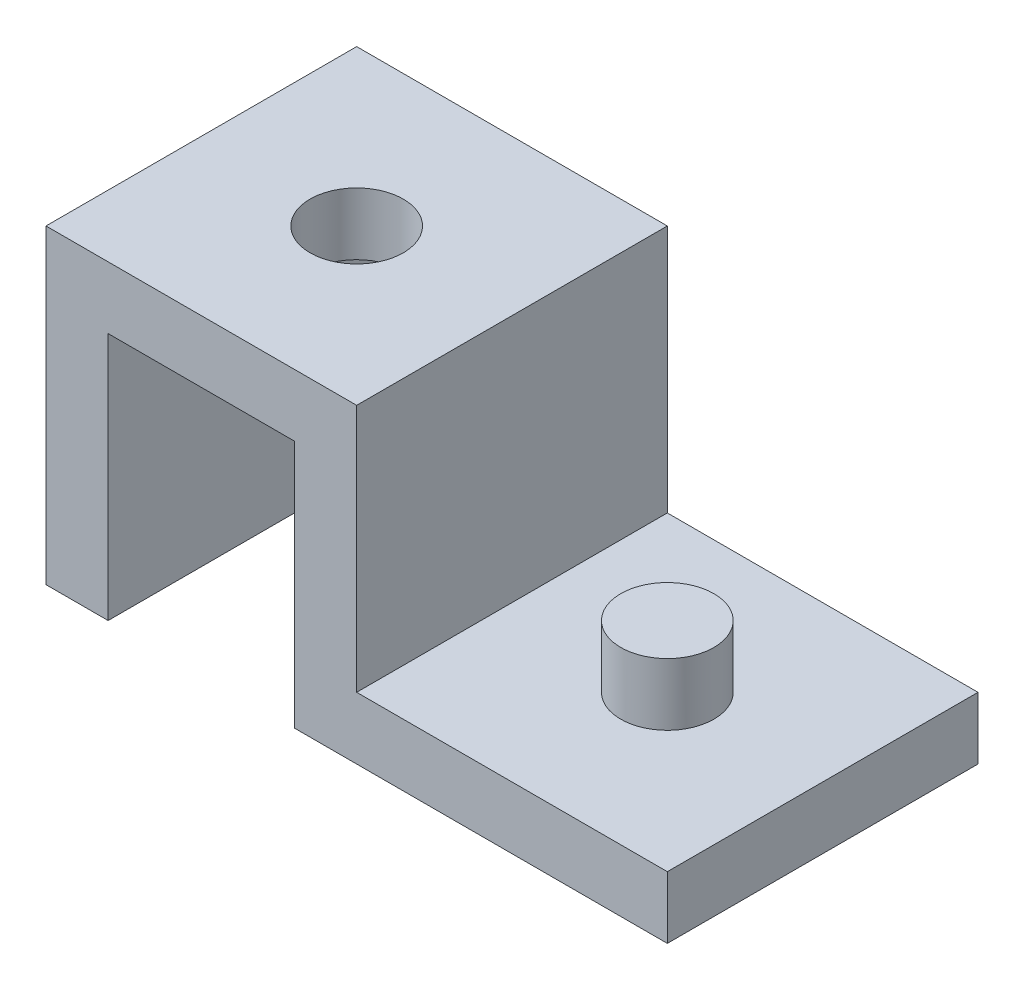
from build123d import *

# Parameters (mm, degrees)
SKETCH_1_W          = 100
SKETCH_1_H          = 50
EXTRUDE_1_DEPTH     = 50
SKETCH_2_W          = 50
SKETCH_2_H          = 40
CUT_EXTRUDE_1_DEPTH = 123.474487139
SKETCH_3_W          = 30
SKETCH_3_H          = 40
CUT_EXTRUDE_2_DEPTH = 123.474487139
SKETCH_4_R          = 7.5
CUT_EXTRUDE_3_DEPTH = 123.474487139
SKETCH_5_R          = 7.5
EXTRUDE_2_DEPTH     = 20


with BuildPart() as part:
    # Sketch 1 → Extrude 1 (new body)
    with BuildSketch(Plane(origin=(0, 0, 0), x_dir=(1, 0, 0), z_dir=(0, 1, 0))):
        with Locations((50, 25)):
            Rectangle(SKETCH_1_W, SKETCH_1_H)
    extrude(amount=EXTRUDE_1_DEPTH)

    # Sketch 2 → Cut-Extrude 1 (cut, through all)
    with BuildSketch(Plane.XY):
        with Locations((75, 30)):
            Rectangle(SKETCH_2_W, SKETCH_2_H)
    extrude(amount=-CUT_EXTRUDE_1_DEPTH, mode=Mode.SUBTRACT)

    # Sketch 3 → Cut-Extrude 2 (cut, through all)
    with BuildSketch(Plane.XY):
        with Locations((25, 20)):
            Rectangle(SKETCH_3_W, SKETCH_3_H)
    extrude(amount=-CUT_EXTRUDE_2_DEPTH, mode=Mode.SUBTRACT)

    # Sketch 4 → Cut-Extrude 3 (cut, through all)
    with BuildSketch(Plane(origin=(0, 50, 0), x_dir=(1, 0, 0), z_dir=(0, 1, 0))):
        with Locations(Location((25, 25, 0), (0, 0, 270))):
            Circle(SKETCH_4_R)
    extrude(amount=-CUT_EXTRUDE_3_DEPTH, mode=Mode.SUBTRACT)

    # Sketch 5 → Extrude 2 (add)
    with BuildSketch(Plane.XZ):
        with Locations(Location((75, -25, 0), (0, 0, 270))):
            Circle(SKETCH_5_R)
    extrude(amount=-EXTRUDE_2_DEPTH)


solid = part.part
